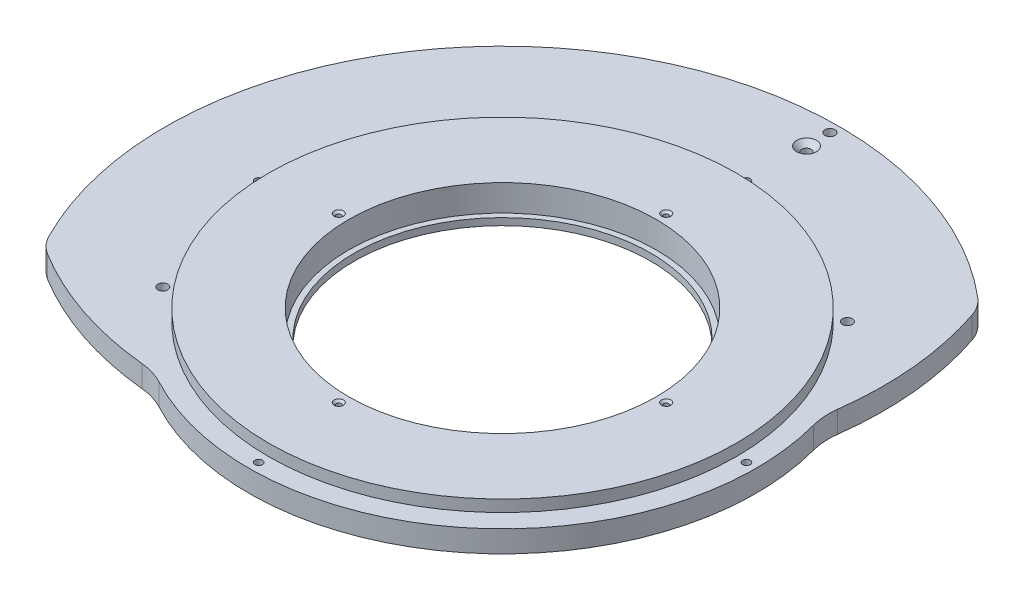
ISO-10303-21;
HEADER;
FILE_DESCRIPTION(('STEP AP214'),'2;1');
FILE_NAME('part.step','',(''),(''),'','','');
FILE_SCHEMA(('AUTOMOTIVE_DESIGN { 1 0 10303 214 1 1 1 1 }'));
ENDSEC;
DATA;
#1=APPLICATION_CONTEXT('core data for automotive mechanical design processes');
#2=APPLICATION_PROTOCOL_DEFINITION('international standard','automotive_design',2000,#1);
#3=PRODUCT_CONTEXT('',#1,'mechanical');
#4=PRODUCT('Part','Part','',(#3));
#5=PRODUCT_RELATED_PRODUCT_CATEGORY('part','',(#4));
#6=PRODUCT_DEFINITION_FORMATION('','',#4);
#7=PRODUCT_DEFINITION_CONTEXT('part definition',#1,'design');
#8=PRODUCT_DEFINITION('design','',#6,#7);
#9=PRODUCT_DEFINITION_SHAPE('','',#8);
#10=(LENGTH_UNIT() NAMED_UNIT(*) SI_UNIT(.MILLI.,.METRE.));
#11=(NAMED_UNIT(*) PLANE_ANGLE_UNIT() SI_UNIT($,.RADIAN.));
#12=(NAMED_UNIT(*) SI_UNIT($,.STERADIAN.) SOLID_ANGLE_UNIT());
#13=UNCERTAINTY_MEASURE_WITH_UNIT(LENGTH_MEASURE(1.E-05),#10,'distance_accuracy_value','');
#14=(GEOMETRIC_REPRESENTATION_CONTEXT(3) GLOBAL_UNCERTAINTY_ASSIGNED_CONTEXT((#13)) GLOBAL_UNIT_ASSIGNED_CONTEXT((#10,
#11,#12)) REPRESENTATION_CONTEXT('',''));
#15=CARTESIAN_POINT('',(0.,0.,0.));
#16=DIRECTION('',(0.,0.,1.));
#17=DIRECTION('',(1.,0.,0.));
#18=AXIS2_PLACEMENT_3D('',#15,#16,#17);
#19=CARTESIAN_POINT('',(90.8178544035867,1219.2,-108.232504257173));
#20=DIRECTION('',(0.,-1.,0.));
#21=DIRECTION('',(0.,0.,-1.));
#22=AXIS2_PLACEMENT_3D('',#19,#20,#21);
#23=CYLINDRICAL_SURFACE('',#22,18.9991999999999);
#24=CARTESIAN_POINT('',(90.8178544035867,1213.64375,-108.232504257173));
#25=DIRECTION('',(0.,1.,0.));
#26=DIRECTION('',(0.,0.,1.));
#27=AXIS2_PLACEMENT_3D('',#24,#25,#26);
#28=CIRCLE('',#27,18.9991999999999);
#29=CARTESIAN_POINT('',(108.840433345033,1213.64375,-114.245510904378));
#30=VERTEX_POINT('',#29);
#31=CARTESIAN_POINT('',(103.030304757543,1213.64375,-122.786735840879));
#32=VERTEX_POINT('',#31);
#33=EDGE_CURVE('E103',#30,#32,#28,.T.);
#34=ORIENTED_EDGE('',*,*,#33,.F.);
#35=DIRECTION('',(0.,-1.,0.));
#36=VECTOR('',#35,1.);
#37=CARTESIAN_POINT('',(108.840433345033,1219.2,-114.245510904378));
#38=LINE('',#37,#36);
#39=CARTESIAN_POINT('',(108.840433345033,1203.325,-114.245510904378));
#40=VERTEX_POINT('',#39);
#41=EDGE_CURVE('E61',#30,#40,#38,.T.);
#42=ORIENTED_EDGE('',*,*,#41,.T.);
#43=CARTESIAN_POINT('',(90.8178544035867,1203.325,-108.232504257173));
#44=DIRECTION('',(0.,1.,0.));
#45=DIRECTION('',(0.,0.,1.));
#46=AXIS2_PLACEMENT_3D('',#43,#44,#45);
#47=CIRCLE('',#46,18.9991999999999);
#48=CARTESIAN_POINT('',(103.030304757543,1203.325,-122.786735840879));
#49=VERTEX_POINT('',#48);
#50=EDGE_CURVE('E108',#40,#49,#47,.T.);
#51=ORIENTED_EDGE('',*,*,#50,.T.);
#52=DIRECTION('',(0.,-1.,0.));
#53=VECTOR('',#52,1.);
#54=CARTESIAN_POINT('',(103.030304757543,1219.2,-122.786735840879));
#55=LINE('',#54,#53);
#56=EDGE_CURVE('E46',#32,#49,#55,.T.);
#57=ORIENTED_EDGE('',*,*,#56,.F.);
#58=EDGE_LOOP('',(#34,#42,#51,#57));
#59=FACE_BOUND('',#58,.T.);
#60=ADVANCED_FACE('F38',(#59),#23,.T.);
#61=CARTESIAN_POINT('',(0.,1219.2,0.));
#62=DIRECTION('',(0.,-1.,0.));
#63=DIRECTION('',(0.,0.,-1.));
#64=AXIS2_PLACEMENT_3D('',#61,#62,#63);
#65=CYLINDRICAL_SURFACE('',#64,160.2867);
#66=CARTESIAN_POINT('',(0.,1213.64375,0.));
#67=DIRECTION('',(0.,1.,0.));
#68=DIRECTION('',(0.,0.,1.));
#69=AXIS2_PLACEMENT_3D('',#66,#67,#68);
#70=CIRCLE('',#69,160.2867);
#71=CARTESIAN_POINT('',(-142.816495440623,1213.64375,72.7686390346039));
#72=VERTEX_POINT('',#71);
#73=EDGE_CURVE('E109',#32,#72,#70,.T.);
#74=ORIENTED_EDGE('',*,*,#73,.F.);
#75=ORIENTED_EDGE('',*,*,#56,.T.);
#76=CARTESIAN_POINT('',(0.,1203.325,0.));
#77=DIRECTION('',(0.,1.,0.));
#78=DIRECTION('',(0.,0.,1.));
#79=AXIS2_PLACEMENT_3D('',#76,#77,#78);
#80=CIRCLE('',#79,160.2867);
#81=CARTESIAN_POINT('',(-142.816495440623,1203.325,72.7686390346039));
#82=VERTEX_POINT('',#81);
#83=EDGE_CURVE('E245',#49,#82,#80,.T.);
#84=ORIENTED_EDGE('',*,*,#83,.T.);
#85=DIRECTION('',(0.,-1.,0.));
#86=VECTOR('',#85,1.);
#87=CARTESIAN_POINT('',(-142.816495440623,1219.2,72.7686390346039));
#88=LINE('',#87,#86);
#89=EDGE_CURVE('E132',#72,#82,#88,.T.);
#90=ORIENTED_EDGE('',*,*,#89,.F.);
#91=EDGE_LOOP('',(#74,#75,#84,#90));
#92=FACE_BOUND('',#91,.T.);
#93=ADVANCED_FACE('F276',(#92),#65,.T.);
#94=CARTESIAN_POINT('',(-125.888084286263,1219.2,64.1431827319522));
#95=DIRECTION('',(0.,-1.,0.));
#96=DIRECTION('',(0.,0.,-1.));
#97=AXIS2_PLACEMENT_3D('',#94,#95,#96);
#98=CYLINDRICAL_SURFACE('',#97,18.9992);
#99=CARTESIAN_POINT('',(-125.888084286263,1213.64375,64.1431827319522));
#100=DIRECTION('',(0.,1.,0.));
#101=DIRECTION('',(0.,0.,1.));
#102=AXIS2_PLACEMENT_3D('',#99,#100,#101);
#103=CIRCLE('',#102,18.9992);
#104=CARTESIAN_POINT('',(-135.801176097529,1213.64375,80.351211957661));
#105=VERTEX_POINT('',#104);
#106=EDGE_CURVE('E241',#72,#105,#103,.T.);
#107=ORIENTED_EDGE('',*,*,#106,.F.);
#108=ORIENTED_EDGE('',*,*,#89,.T.);
#109=CARTESIAN_POINT('',(-125.888084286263,1203.325,64.1431827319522));
#110=DIRECTION('',(0.,1.,0.));
#111=DIRECTION('',(0.,0.,1.));
#112=AXIS2_PLACEMENT_3D('',#109,#110,#111);
#113=CIRCLE('',#112,18.9992);
#114=CARTESIAN_POINT('',(-135.801176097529,1203.325,80.351211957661));
#115=VERTEX_POINT('',#114);
#116=EDGE_CURVE('E248',#82,#115,#113,.T.);
#117=ORIENTED_EDGE('',*,*,#116,.T.);
#118=DIRECTION('',(0.,-1.,0.));
#119=VECTOR('',#118,1.);
#120=CARTESIAN_POINT('',(-135.801176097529,1219.2,80.351211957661));
#121=LINE('',#120,#119);
#122=EDGE_CURVE('E130',#105,#115,#121,.T.);
#123=ORIENTED_EDGE('',*,*,#122,.F.);
#124=EDGE_LOOP('',(#107,#108,#117,#123));
#125=FACE_BOUND('',#124,.T.);
#126=ADVANCED_FACE('F281',(#125),#98,.T.);
#127=CARTESIAN_POINT('',(-52.9977033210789,1219.2,-55.0335027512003));
#128=DIRECTION('',(0.,-1.,0.));
#129=DIRECTION('',(0.,0.,-1.));
#130=AXIS2_PLACEMENT_3D('',#127,#128,#129);
#131=CYLINDRICAL_SURFACE('',#130,158.6992);
#132=CARTESIAN_POINT('',(-52.9977033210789,1213.64375,-55.0335027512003));
#133=DIRECTION('',(0.,1.,0.));
#134=DIRECTION('',(0.,0.,1.));
#135=AXIS2_PLACEMENT_3D('',#132,#133,#134);
#136=CIRCLE('',#135,158.6992);
#137=CARTESIAN_POINT('',(-68.4508924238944,1213.64375,102.911535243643));
#138=VERTEX_POINT('',#137);
#139=EDGE_CURVE('E239',#105,#138,#136,.T.);
#140=ORIENTED_EDGE('',*,*,#139,.F.);
#141=ORIENTED_EDGE('',*,*,#122,.T.);
#142=CARTESIAN_POINT('',(-52.9977033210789,1203.325,-55.0335027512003));
#143=DIRECTION('',(0.,1.,0.));
#144=DIRECTION('',(0.,0.,1.));
#145=AXIS2_PLACEMENT_3D('',#142,#143,#144);
#146=CIRCLE('',#145,158.6992);
#147=CARTESIAN_POINT('',(-68.4508924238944,1203.325,102.911535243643));
#148=VERTEX_POINT('',#147);
#149=EDGE_CURVE('E251',#115,#148,#146,.T.);
#150=ORIENTED_EDGE('',*,*,#149,.T.);
#151=DIRECTION('',(0.,-1.,0.));
#152=VECTOR('',#151,1.);
#153=CARTESIAN_POINT('',(-68.4508924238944,1219.2,102.911535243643));
#154=LINE('',#153,#152);
#155=EDGE_CURVE('E128',#138,#148,#154,.T.);
#156=ORIENTED_EDGE('',*,*,#155,.F.);
#157=EDGE_LOOP('',(#140,#141,#150,#156));
#158=FACE_BOUND('',#157,.T.);
#159=ADVANCED_FACE('F283',(#158),#131,.T.);
#160=CARTESIAN_POINT('',(-71.5474661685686,1219.2,134.561213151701));
#161=DIRECTION('',(0.,-1.,0.));
#162=DIRECTION('',(0.,0.,-1.));
#163=AXIS2_PLACEMENT_3D('',#160,#161,#162);
#164=CYLINDRICAL_SURFACE('',#163,31.8008);
#165=CARTESIAN_POINT('',(-71.5474661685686,1213.64375,134.561213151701));
#166=DIRECTION('',(0.,1.,0.));
#167=DIRECTION('',(0.,0.,1.));
#168=AXIS2_PLACEMENT_3D('',#165,#166,#167);
#169=CIRCLE('',#168,31.8008);
#170=CARTESIAN_POINT('',(-56.6178948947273,1213.64375,106.482773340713));
#171=VERTEX_POINT('',#170);
#172=EDGE_CURVE('E237',#138,#171,#169,.F.);
#173=ORIENTED_EDGE('',*,*,#172,.F.);
#174=ORIENTED_EDGE('',*,*,#155,.T.);
#175=CARTESIAN_POINT('',(-71.5474661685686,1203.325,134.561213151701));
#176=DIRECTION('',(0.,-1.,0.));
#177=DIRECTION('',(0.,0.,1.));
#178=AXIS2_PLACEMENT_3D('',#175,#176,#177);
#179=CIRCLE('',#178,31.8008);
#180=CARTESIAN_POINT('',(-56.6178948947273,1203.325,106.482773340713));
#181=VERTEX_POINT('',#180);
#182=EDGE_CURVE('E255',#148,#181,#179,.T.);
#183=ORIENTED_EDGE('',*,*,#182,.T.);
#184=DIRECTION('',(0.,-1.,0.));
#185=VECTOR('',#184,1.);
#186=CARTESIAN_POINT('',(-56.6178948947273,1219.2,106.482773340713));
#187=LINE('',#186,#185);
#188=EDGE_CURVE('E125',#171,#181,#187,.T.);
#189=ORIENTED_EDGE('',*,*,#188,.F.);
#190=EDGE_LOOP('',(#173,#174,#183,#189));
#191=FACE_BOUND('',#190,.T.);
#192=ADVANCED_FACE('F290',(#191),#164,.F.);
#193=CARTESIAN_POINT('',(0.,1219.2,0.));
#194=DIRECTION('',(0.,-1.,0.));
#195=DIRECTION('',(0.,0.,-1.));
#196=AXIS2_PLACEMENT_3D('',#193,#194,#195);
#197=CYLINDRICAL_SURFACE('',#196,120.5992);
#198=CARTESIAN_POINT('',(0.,1213.64375,0.));
#199=DIRECTION('',(0.,1.,0.));
#200=DIRECTION('',(0.,0.,1.));
#201=AXIS2_PLACEMENT_3D('',#198,#199,#200);
#202=CIRCLE('',#201,120.5992);
#203=CARTESIAN_POINT('',(116.489881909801,1213.64375,-31.2133697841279));
#204=VERTEX_POINT('',#203);
#205=EDGE_CURVE('E235',#171,#204,#202,.T.);
#206=ORIENTED_EDGE('',*,*,#205,.F.);
#207=ORIENTED_EDGE('',*,*,#188,.T.);
#208=CARTESIAN_POINT('',(0.,1203.325,0.));
#209=DIRECTION('',(0.,1.,0.));
#210=DIRECTION('',(0.,0.,1.));
#211=AXIS2_PLACEMENT_3D('',#208,#209,#210);
#212=CIRCLE('',#211,120.5992);
#213=CARTESIAN_POINT('',(116.489881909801,1203.325,-31.2133697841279));
#214=VERTEX_POINT('',#213);
#215=EDGE_CURVE('E258',#181,#214,#212,.T.);
#216=ORIENTED_EDGE('',*,*,#215,.T.);
#217=DIRECTION('',(0.,-1.,0.));
#218=VECTOR('',#217,1.);
#219=CARTESIAN_POINT('',(116.489881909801,1219.2,-31.2133697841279));
#220=LINE('',#219,#218);
#221=EDGE_CURVE('E117',#204,#214,#220,.T.);
#222=ORIENTED_EDGE('',*,*,#221,.F.);
#223=EDGE_LOOP('',(#206,#207,#216,#222));
#224=FACE_BOUND('',#223,.T.);
#225=ADVANCED_FACE('F292',(#224),#197,.T.);
#226=CARTESIAN_POINT('',(147.207095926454,1219.2,-39.4440224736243));
#227=DIRECTION('',(0.,-1.,0.));
#228=DIRECTION('',(0.,0.,-1.));
#229=AXIS2_PLACEMENT_3D('',#226,#227,#228);
#230=CYLINDRICAL_SURFACE('',#229,31.8008000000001);
#231=CARTESIAN_POINT('',(147.207095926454,1213.64375,-39.4440224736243));
#232=DIRECTION('',(0.,1.,0.));
#233=DIRECTION('',(0.,0.,1.));
#234=AXIS2_PLACEMENT_3D('',#231,#232,#233);
#235=CIRCLE('',#234,31.8008000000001);
#236=CARTESIAN_POINT('',(115.67201968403,1213.64375,-43.5464421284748));
#237=VERTEX_POINT('',#236);
#238=EDGE_CURVE('E53',#204,#237,#235,.F.);
#239=ORIENTED_EDGE('',*,*,#238,.F.);
#240=ORIENTED_EDGE('',*,*,#221,.T.);
#241=CARTESIAN_POINT('',(147.207095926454,1203.325,-39.4440224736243));
#242=DIRECTION('',(0.,-1.,0.));
#243=DIRECTION('',(0.,0.,1.));
#244=AXIS2_PLACEMENT_3D('',#241,#242,#243);
#245=CIRCLE('',#244,31.8008000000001);
#246=CARTESIAN_POINT('',(115.67201968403,1203.325,-43.5464421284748));
#247=VERTEX_POINT('',#246);
#248=EDGE_CURVE('E120',#214,#247,#245,.T.);
#249=ORIENTED_EDGE('',*,*,#248,.T.);
#250=DIRECTION('',(0.,-1.,0.));
#251=VECTOR('',#250,1.);
#252=CARTESIAN_POINT('',(115.67201968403,1219.2,-43.5464421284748));
#253=LINE('',#252,#251);
#254=EDGE_CURVE('E115',#237,#247,#253,.T.);
#255=ORIENTED_EDGE('',*,*,#254,.F.);
#256=EDGE_LOOP('',(#239,#240,#249,#255));
#257=FACE_BOUND('',#256,.T.);
#258=ADVANCED_FACE('F266',(#257),#230,.F.);
#259=CARTESIAN_POINT('',(-41.701108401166,1219.2,-64.0192200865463));
#260=DIRECTION('',(0.,-1.,0.));
#261=DIRECTION('',(0.,0.,-1.));
#262=AXIS2_PLACEMENT_3D('',#259,#260,#261);
#263=CYLINDRICAL_SURFACE('',#262,158.6992);
#264=CARTESIAN_POINT('',(-41.701108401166,1213.64375,-64.0192200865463));
#265=DIRECTION('',(0.,1.,0.));
#266=DIRECTION('',(0.,0.,1.));
#267=AXIS2_PLACEMENT_3D('',#264,#265,#266);
#268=CIRCLE('',#267,158.6992);
#269=EDGE_CURVE('E11',#237,#30,#268,.T.);
#270=ORIENTED_EDGE('',*,*,#269,.F.);
#271=ORIENTED_EDGE('',*,*,#254,.T.);
#272=CARTESIAN_POINT('',(-41.701108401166,1203.325,-64.0192200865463));
#273=DIRECTION('',(0.,1.,0.));
#274=DIRECTION('',(0.,0.,1.));
#275=AXIS2_PLACEMENT_3D('',#272,#273,#274);
#276=CIRCLE('',#275,158.6992);
#277=EDGE_CURVE('E113',#247,#40,#276,.T.);
#278=ORIENTED_EDGE('',*,*,#277,.T.);
#279=ORIENTED_EDGE('',*,*,#41,.F.);
#280=EDGE_LOOP('',(#270,#271,#278,#279));
#281=FACE_BOUND('',#280,.T.);
#282=ADVANCED_FACE('F111',(#281),#263,.T.);
#283=CARTESIAN_POINT('',(45.4089272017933,1203.325,-54.1162521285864));
#284=DIRECTION('',(0.,1.,0.));
#285=DIRECTION('',(0.,0.,1.));
#286=AXIS2_PLACEMENT_3D('',#283,#284,#285);
#287=PLANE('',#286);
#288=CARTESIAN_POINT('',(115.8875,1203.325,1.21385713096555E-12));
#289=DIRECTION('',(0.,1.,0.));
#290=DIRECTION('',(0.,0.,1.));
#291=AXIS2_PLACEMENT_3D('',#288,#289,#290);
#292=CIRCLE('',#291,1.);
#293=CARTESIAN_POINT('',(115.8875,1203.325,1.00000000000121));
#294=VERTEX_POINT('',#293);
#295=EDGE_CURVE('E706',#294,#294,#292,.T.);
#296=ORIENTED_EDGE('',*,*,#295,.T.);
#297=EDGE_LOOP('',(#296));
#298=FACE_BOUND('',#297,.T.);
#299=CARTESIAN_POINT('',(0.,1203.325,-115.8875));
#300=DIRECTION('',(0.,1.,0.));
#301=DIRECTION('',(0.,0.,1.));
#302=AXIS2_PLACEMENT_3D('',#299,#300,#301);
#303=CIRCLE('',#302,0.999999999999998);
#304=CARTESIAN_POINT('',(0.,1203.325,-114.8875));
#305=VERTEX_POINT('',#304);
#306=EDGE_CURVE('E718',#305,#305,#303,.T.);
#307=ORIENTED_EDGE('',*,*,#306,.T.);
#308=EDGE_LOOP('',(#307));
#309=FACE_BOUND('',#308,.T.);
#310=CARTESIAN_POINT('',(-115.8875,1203.325,-4.04619043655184E-13));
#311=DIRECTION('',(0.,1.,0.));
#312=DIRECTION('',(0.,0.,1.));
#313=AXIS2_PLACEMENT_3D('',#310,#311,#312);
#314=CIRCLE('',#313,1.);
#315=CARTESIAN_POINT('',(-115.8875,1203.325,0.999999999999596));
#316=VERTEX_POINT('',#315);
#317=EDGE_CURVE('E730',#316,#316,#314,.T.);
#318=ORIENTED_EDGE('',*,*,#317,.T.);
#319=EDGE_LOOP('',(#318));
#320=FACE_BOUND('',#319,.T.);
#321=CARTESIAN_POINT('',(-8.14780813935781E-13,1203.325,-77.7875));
#322=DIRECTION('',(0.,1.,0.));
#323=DIRECTION('',(0.,0.,1.));
#324=AXIS2_PLACEMENT_3D('',#321,#322,#323);
#325=CIRCLE('',#324,1.2);
#326=CARTESIAN_POINT('',(-8.14780813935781E-13,1203.325,-76.5875));
#327=VERTEX_POINT('',#326);
#328=EDGE_CURVE('E41',#327,#327,#325,.T.);
#329=ORIENTED_EDGE('',*,*,#328,.T.);
#330=EDGE_LOOP('',(#329));
#331=FACE_BOUND('',#330,.T.);
#332=CARTESIAN_POINT('',(77.7875,1203.325,0.));
#333=DIRECTION('',(0.,1.,0.));
#334=DIRECTION('',(0.,0.,1.));
#335=AXIS2_PLACEMENT_3D('',#332,#333,#334);
#336=CIRCLE('',#335,1.19999999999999);
#337=CARTESIAN_POINT('',(77.7875,1203.325,1.19999999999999));
#338=VERTEX_POINT('',#337);
#339=EDGE_CURVE('E155',#338,#338,#336,.T.);
#340=ORIENTED_EDGE('',*,*,#339,.T.);
#341=EDGE_LOOP('',(#340));
#342=FACE_BOUND('',#341,.T.);
#343=CARTESIAN_POINT('',(2.7159360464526E-13,1203.325,77.7875));
#344=DIRECTION('',(0.,1.,0.));
#345=DIRECTION('',(0.,0.,1.));
#346=AXIS2_PLACEMENT_3D('',#343,#344,#345);
#347=CIRCLE('',#346,1.2);
#348=CARTESIAN_POINT('',(2.7159360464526E-13,1203.325,78.9875));
#349=VERTEX_POINT('',#348);
#350=EDGE_CURVE('E151',#349,#349,#347,.T.);
#351=ORIENTED_EDGE('',*,*,#350,.T.);
#352=EDGE_LOOP('',(#351));
#353=FACE_BOUND('',#352,.T.);
#354=CARTESIAN_POINT('',(0.,1203.325,-155.575));
#355=DIRECTION('',(0.,1.,0.));
#356=DIRECTION('',(0.,0.,1.));
#357=AXIS2_PLACEMENT_3D('',#354,#355,#356);
#358=CIRCLE('',#357,2.18281250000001);
#359=CARTESIAN_POINT('',(0.,1203.325,-153.3921875));
#360=VERTEX_POINT('',#359);
#361=EDGE_CURVE('E146',#360,#360,#358,.T.);
#362=ORIENTED_EDGE('',*,*,#361,.T.);
#363=EDGE_LOOP('',(#362));
#364=FACE_BOUND('',#363,.T.);
#365=CARTESIAN_POINT('',(0.,1203.325,-144.4625));
#366=DIRECTION('',(0.,1.,0.));
#367=DIRECTION('',(0.,0.,1.));
#368=AXIS2_PLACEMENT_3D('',#365,#366,#367);
#369=CIRCLE('',#368,2.25);
#370=CARTESIAN_POINT('',(0.,1203.325,-142.2125));
#371=VERTEX_POINT('',#370);
#372=EDGE_CURVE('E149',#371,#371,#369,.T.);
#373=ORIENTED_EDGE('',*,*,#372,.T.);
#374=EDGE_LOOP('',(#373));
#375=FACE_BOUND('',#374,.T.);
#376=CARTESIAN_POINT('',(-94.9294825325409,1203.325,66.4703392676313));
#377=DIRECTION('',(0.,1.,0.));
#378=DIRECTION('',(0.,0.,1.));
#379=AXIS2_PLACEMENT_3D('',#376,#377,#378);
#380=CIRCLE('',#379,2.36855000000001);
#381=CARTESIAN_POINT('',(-94.9294825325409,1203.325,68.8388892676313));
#382=VERTEX_POINT('',#381);
#383=EDGE_CURVE('E192',#382,#382,#380,.T.);
#384=ORIENTED_EDGE('',*,*,#383,.T.);
#385=EDGE_LOOP('',(#384));
#386=FACE_BOUND('',#385,.T.);
#387=CARTESIAN_POINT('',(81.944837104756,1203.325,-81.944837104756));
#388=DIRECTION('',(0.,1.,0.));
#389=DIRECTION('',(0.,0.,1.));
#390=AXIS2_PLACEMENT_3D('',#387,#388,#389);
#391=CIRCLE('',#390,2.36855000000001);
#392=CARTESIAN_POINT('',(81.944837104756,1203.325,-79.576287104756));
#393=VERTEX_POINT('',#392);
#394=EDGE_CURVE('E140',#393,#393,#391,.T.);
#395=ORIENTED_EDGE('',*,*,#394,.T.);
#396=EDGE_LOOP('',(#395));
#397=FACE_BOUND('',#396,.T.);
#398=CARTESIAN_POINT('',(0.,1203.325,115.8875));
#399=DIRECTION('',(0.,1.,0.));
#400=DIRECTION('',(0.,0.,1.));
#401=AXIS2_PLACEMENT_3D('',#398,#399,#400);
#402=CIRCLE('',#401,0.999999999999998);
#403=CARTESIAN_POINT('',(0.,1203.325,116.8875));
#404=VERTEX_POINT('',#403);
#405=EDGE_CURVE('E206',#404,#404,#402,.T.);
#406=ORIENTED_EDGE('',*,*,#405,.T.);
#407=EDGE_LOOP('',(#406));
#408=FACE_BOUND('',#407,.T.);
#409=CARTESIAN_POINT('',(-77.7875,1203.325,0.));
#410=DIRECTION('',(0.,1.,0.));
#411=DIRECTION('',(0.,0.,1.));
#412=AXIS2_PLACEMENT_3D('',#409,#410,#411);
#413=CIRCLE('',#412,1.19999999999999);
#414=CARTESIAN_POINT('',(-77.7875,1203.325,1.19999999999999));
#415=VERTEX_POINT('',#414);
#416=EDGE_CURVE('E135',#415,#415,#413,.T.);
#417=ORIENTED_EDGE('',*,*,#416,.T.);
#418=EDGE_LOOP('',(#417));
#419=FACE_BOUND('',#418,.T.);
#420=CARTESIAN_POINT('',(0.,1203.325,0.));
#421=DIRECTION('',(0.,1.,0.));
#422=DIRECTION('',(0.,0.,1.));
#423=AXIS2_PLACEMENT_3D('',#420,#421,#422);
#424=CIRCLE('',#423,70.4215);
#425=CARTESIAN_POINT('',(0.,1203.325,70.4215));
#426=VERTEX_POINT('',#425);
#427=EDGE_CURVE('E214',#426,#426,#424,.T.);
#428=ORIENTED_EDGE('',*,*,#427,.T.);
#429=EDGE_LOOP('',(#428));
#430=FACE_BOUND('',#429,.T.);
#431=ORIENTED_EDGE('',*,*,#50,.F.);
#432=ORIENTED_EDGE('',*,*,#277,.F.);
#433=ORIENTED_EDGE('',*,*,#248,.F.);
#434=ORIENTED_EDGE('',*,*,#215,.F.);
#435=ORIENTED_EDGE('',*,*,#182,.F.);
#436=ORIENTED_EDGE('',*,*,#149,.F.);
#437=ORIENTED_EDGE('',*,*,#116,.F.);
#438=ORIENTED_EDGE('',*,*,#83,.F.);
#439=EDGE_LOOP('',(#431,#432,#433,#434,#435,#436,#437,#438));
#440=FACE_BOUND('',#439,.T.);
#441=ADVANCED_FACE('F270',(#298,#309,#320,#331,#342,#353,#364,#375,#386,#397,#408,#419,#430,
#440),#287,.F.);
#442=CARTESIAN_POINT('',(0.,1213.64375,0.));
#443=DIRECTION('',(0.,1.,0.));
#444=DIRECTION('',(0.,0.,1.));
#445=AXIS2_PLACEMENT_3D('',#442,#443,#444);
#446=PLANE('',#445);
#447=CARTESIAN_POINT('',(115.8875,1213.64374999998,1.21385713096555E-12));
#448=DIRECTION('',(0.,1.,0.));
#449=DIRECTION('',(0.,0.,1.));
#450=AXIS2_PLACEMENT_3D('',#447,#448,#449);
#451=CIRCLE('',#450,1.8);
#452=CARTESIAN_POINT('',(115.8875,1213.64374999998,1.80000000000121));
#453=VERTEX_POINT('',#452);
#454=EDGE_CURVE('E699',#453,#453,#451,.T.);
#455=ORIENTED_EDGE('',*,*,#454,.F.);
#456=EDGE_LOOP('',(#455));
#457=FACE_BOUND('',#456,.T.);
#458=CARTESIAN_POINT('',(0.,1213.64374999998,-115.8875));
#459=DIRECTION('',(0.,1.,0.));
#460=DIRECTION('',(0.,0.,1.));
#461=AXIS2_PLACEMENT_3D('',#458,#459,#460);
#462=CIRCLE('',#461,1.8);
#463=CARTESIAN_POINT('',(0.,1213.64374999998,-114.0875));
#464=VERTEX_POINT('',#463);
#465=EDGE_CURVE('E709',#464,#464,#462,.T.);
#466=ORIENTED_EDGE('',*,*,#465,.F.);
#467=EDGE_LOOP('',(#466));
#468=FACE_BOUND('',#467,.T.);
#469=CARTESIAN_POINT('',(-115.8875,1213.64374999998,-4.04619043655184E-13));
#470=DIRECTION('',(0.,1.,0.));
#471=DIRECTION('',(0.,0.,1.));
#472=AXIS2_PLACEMENT_3D('',#469,#470,#471);
#473=CIRCLE('',#472,1.8);
#474=CARTESIAN_POINT('',(-115.8875,1213.64374999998,1.79999999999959));
#475=VERTEX_POINT('',#474);
#476=EDGE_CURVE('E721',#475,#475,#473,.T.);
#477=ORIENTED_EDGE('',*,*,#476,.F.);
#478=EDGE_LOOP('',(#477));
#479=FACE_BOUND('',#478,.T.);
#480=CARTESIAN_POINT('',(0.,1213.64375000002,-155.575));
#481=DIRECTION('',(0.,1.,0.));
#482=DIRECTION('',(0.,0.,1.));
#483=AXIS2_PLACEMENT_3D('',#480,#481,#482);
#484=CIRCLE('',#483,2.39395);
#485=CARTESIAN_POINT('',(0.,1213.64375000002,-153.18105));
#486=VERTEX_POINT('',#485);
#487=EDGE_CURVE('E153',#486,#486,#484,.T.);
#488=ORIENTED_EDGE('',*,*,#487,.F.);
#489=EDGE_LOOP('',(#488));
#490=FACE_BOUND('',#489,.T.);
#491=CARTESIAN_POINT('',(0.,1213.64375000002,-144.4625));
#492=DIRECTION('',(0.,1.,0.));
#493=DIRECTION('',(0.,0.,1.));
#494=AXIS2_PLACEMENT_3D('',#491,#492,#493);
#495=CIRCLE('',#494,4.7);
#496=CARTESIAN_POINT('',(0.,1213.64375000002,-139.7625));
#497=VERTEX_POINT('',#496);
#498=EDGE_CURVE('E186',#497,#497,#495,.T.);
#499=ORIENTED_EDGE('',*,*,#498,.F.);
#500=EDGE_LOOP('',(#499));
#501=FACE_BOUND('',#500,.T.);
#502=CARTESIAN_POINT('',(-94.9294825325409,1213.64374999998,66.4703392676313));
#503=DIRECTION('',(0.,1.,0.));
#504=DIRECTION('',(0.,0.,1.));
#505=AXIS2_PLACEMENT_3D('',#502,#503,#504);
#506=CIRCLE('',#505,2.36855000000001);
#507=CARTESIAN_POINT('',(-94.9294825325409,1213.64374999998,68.8388892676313));
#508=VERTEX_POINT('',#507);
#509=EDGE_CURVE('E189',#508,#508,#506,.T.);
#510=ORIENTED_EDGE('',*,*,#509,.F.);
#511=EDGE_LOOP('',(#510));
#512=FACE_BOUND('',#511,.T.);
#513=CARTESIAN_POINT('',(81.944837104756,1213.64374999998,-81.944837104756));
#514=DIRECTION('',(0.,1.,0.));
#515=DIRECTION('',(0.,0.,1.));
#516=AXIS2_PLACEMENT_3D('',#513,#514,#515);
#517=CIRCLE('',#516,2.36855000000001);
#518=CARTESIAN_POINT('',(81.944837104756,1213.64374999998,-79.576287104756));
#519=VERTEX_POINT('',#518);
#520=EDGE_CURVE('E145',#519,#519,#517,.T.);
#521=ORIENTED_EDGE('',*,*,#520,.F.);
#522=EDGE_LOOP('',(#521));
#523=FACE_BOUND('',#522,.T.);
#524=CARTESIAN_POINT('',(0.,1213.64374999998,115.8875));
#525=DIRECTION('',(0.,1.,0.));
#526=DIRECTION('',(0.,0.,1.));
#527=AXIS2_PLACEMENT_3D('',#524,#525,#526);
#528=CIRCLE('',#527,1.8);
#529=CARTESIAN_POINT('',(0.,1213.64374999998,117.6875));
#530=VERTEX_POINT('',#529);
#531=EDGE_CURVE('E144',#530,#530,#528,.T.);
#532=ORIENTED_EDGE('',*,*,#531,.F.);
#533=EDGE_LOOP('',(#532));
#534=FACE_BOUND('',#533,.T.);
#535=CARTESIAN_POINT('',(0.,1213.64375,0.));
#536=DIRECTION('',(0.,1.,0.));
#537=DIRECTION('',(0.,0.,1.));
#538=AXIS2_PLACEMENT_3D('',#535,#536,#537);
#539=CIRCLE('',#538,111.125);
#540=CARTESIAN_POINT('',(0.,1213.64375,111.125));
#541=VERTEX_POINT('',#540);
#542=EDGE_CURVE('E229',#541,#541,#539,.T.);
#543=ORIENTED_EDGE('',*,*,#542,.F.);
#544=EDGE_LOOP('',(#543));
#545=FACE_BOUND('',#544,.T.);
#546=ORIENTED_EDGE('',*,*,#33,.T.);
#547=ORIENTED_EDGE('',*,*,#73,.T.);
#548=ORIENTED_EDGE('',*,*,#106,.T.);
#549=ORIENTED_EDGE('',*,*,#139,.T.);
#550=ORIENTED_EDGE('',*,*,#172,.T.);
#551=ORIENTED_EDGE('',*,*,#205,.T.);
#552=ORIENTED_EDGE('',*,*,#238,.T.);
#553=ORIENTED_EDGE('',*,*,#269,.T.);
#554=EDGE_LOOP('',(#546,#547,#548,#549,#550,#551,#552,#553));
#555=FACE_BOUND('',#554,.T.);
#556=ADVANCED_FACE('F102',(#457,#468,#479,#490,#501,#512,#523,#534,#545,#555),#446,.T.);
#557=CARTESIAN_POINT('',(0.,1213.64375,0.));
#558=DIRECTION('',(0.,1.,0.));
#559=DIRECTION('',(0.,0.,1.));
#560=AXIS2_PLACEMENT_3D('',#557,#558,#559);
#561=CYLINDRICAL_SURFACE('',#560,111.125);
#562=ORIENTED_EDGE('',*,*,#542,.T.);
#563=EDGE_LOOP('',(#562));
#564=FACE_BOUND('',#563,.T.);
#565=CARTESIAN_POINT('',(0.,1219.2,0.));
#566=DIRECTION('',(0.,1.,0.));
#567=DIRECTION('',(0.,0.,1.));
#568=AXIS2_PLACEMENT_3D('',#565,#566,#567);
#569=CIRCLE('',#568,111.125);
#570=CARTESIAN_POINT('',(0.,1219.2,111.125));
#571=VERTEX_POINT('',#570);
#572=EDGE_CURVE('E225',#571,#571,#569,.T.);
#573=ORIENTED_EDGE('',*,*,#572,.F.);
#574=EDGE_LOOP('',(#573));
#575=FACE_BOUND('',#574,.T.);
#576=ADVANCED_FACE('F344',(#564,#575),#561,.T.);
#577=CARTESIAN_POINT('',(45.4089272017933,1219.2,-54.1162521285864));
#578=DIRECTION('',(0.,1.,0.));
#579=DIRECTION('',(0.,0.,1.));
#580=AXIS2_PLACEMENT_3D('',#577,#578,#579);
#581=PLANE('',#580);
#582=CARTESIAN_POINT('',(-8.14780813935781E-13,1219.20000000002,-77.7875));
#583=DIRECTION('',(0.,1.,0.));
#584=DIRECTION('',(0.,0.,1.));
#585=AXIS2_PLACEMENT_3D('',#582,#583,#584);
#586=CIRCLE('',#585,2.2);
#587=CARTESIAN_POINT('',(-8.14780813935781E-13,1219.20000000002,-75.5875));
#588=VERTEX_POINT('',#587);
#589=EDGE_CURVE('E733',#588,#588,#586,.T.);
#590=ORIENTED_EDGE('',*,*,#589,.F.);
#591=EDGE_LOOP('',(#590));
#592=FACE_BOUND('',#591,.T.);
#593=CARTESIAN_POINT('',(77.7875,1219.20000000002,0.));
#594=DIRECTION('',(0.,1.,0.));
#595=DIRECTION('',(0.,0.,1.));
#596=AXIS2_PLACEMENT_3D('',#593,#594,#595);
#597=CIRCLE('',#596,2.19999999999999);
#598=CARTESIAN_POINT('',(77.7875,1219.20000000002,2.19999999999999));
#599=VERTEX_POINT('',#598);
#600=EDGE_CURVE('E164',#599,#599,#597,.T.);
#601=ORIENTED_EDGE('',*,*,#600,.F.);
#602=EDGE_LOOP('',(#601));
#603=FACE_BOUND('',#602,.T.);
#604=CARTESIAN_POINT('',(2.7159360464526E-13,1219.20000000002,77.7875));
#605=DIRECTION('',(0.,1.,0.));
#606=DIRECTION('',(0.,0.,1.));
#607=AXIS2_PLACEMENT_3D('',#604,#605,#606);
#608=CIRCLE('',#607,2.2);
#609=CARTESIAN_POINT('',(2.7159360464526E-13,1219.20000000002,79.9875));
#610=VERTEX_POINT('',#609);
#611=EDGE_CURVE('E157',#610,#610,#608,.T.);
#612=ORIENTED_EDGE('',*,*,#611,.F.);
#613=EDGE_LOOP('',(#612));
#614=FACE_BOUND('',#613,.T.);
#615=CARTESIAN_POINT('',(-77.7875,1219.20000000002,0.));
#616=DIRECTION('',(0.,1.,0.));
#617=DIRECTION('',(0.,0.,1.));
#618=AXIS2_PLACEMENT_3D('',#615,#616,#617);
#619=CIRCLE('',#618,2.19999999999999);
#620=CARTESIAN_POINT('',(-77.7875,1219.20000000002,2.19999999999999));
#621=VERTEX_POINT('',#620);
#622=EDGE_CURVE('E139',#621,#621,#619,.T.);
#623=ORIENTED_EDGE('',*,*,#622,.F.);
#624=EDGE_LOOP('',(#623));
#625=FACE_BOUND('',#624,.T.);
#626=CARTESIAN_POINT('',(0.,1219.2,0.));
#627=DIRECTION('',(0.,1.,0.));
#628=DIRECTION('',(0.,0.,1.));
#629=AXIS2_PLACEMENT_3D('',#626,#627,#628);
#630=CIRCLE('',#629,73.03135);
#631=CARTESIAN_POINT('',(0.,1219.2,73.03135));
#632=VERTEX_POINT('',#631);
#633=EDGE_CURVE('E218',#632,#632,#630,.T.);
#634=ORIENTED_EDGE('',*,*,#633,.F.);
#635=EDGE_LOOP('',(#634));
#636=FACE_BOUND('',#635,.T.);
#637=ORIENTED_EDGE('',*,*,#572,.T.);
#638=EDGE_LOOP('',(#637));
#639=FACE_BOUND('',#638,.T.);
#640=ADVANCED_FACE('F349',(#592,#603,#614,#625,#636,#639),#581,.T.);
#641=CARTESIAN_POINT('',(0.,1206.6524,0.));
#642=DIRECTION('',(0.,1.,0.));
#643=DIRECTION('',(0.,0.,1.));
#644=AXIS2_PLACEMENT_3D('',#641,#642,#643);
#645=CYLINDRICAL_SURFACE('',#644,73.03135);
#646=CARTESIAN_POINT('',(0.,1206.6524,0.));
#647=DIRECTION('',(0.,1.,0.));
#648=DIRECTION('',(0.,0.,1.));
#649=AXIS2_PLACEMENT_3D('',#646,#647,#648);
#650=CIRCLE('',#649,73.03135);
#651=CARTESIAN_POINT('',(0.,1206.6524,73.03135));
#652=VERTEX_POINT('',#651);
#653=EDGE_CURVE('E221',#652,#652,#650,.T.);
#654=CARTESIAN_POINT('',(0.,1206.6524,73.03135));
#655=CARTESIAN_POINT('',(0.,1206.78310416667,73.03135));
#656=CARTESIAN_POINT('',(0.,1206.91380833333,73.03135));
#657=CARTESIAN_POINT('',(0.,1207.17521666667,73.03135));
#658=CARTESIAN_POINT('',(0.,1207.30592083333,73.03135));
#659=CARTESIAN_POINT('',(0.,1207.56732916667,73.03135));
#660=CARTESIAN_POINT('',(0.,1207.69803333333,73.03135));
#661=CARTESIAN_POINT('',(0.,1207.95944166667,73.03135));
#662=CARTESIAN_POINT('',(0.,1208.09014583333,73.03135));
#663=CARTESIAN_POINT('',(0.,1208.35155416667,73.03135));
#664=CARTESIAN_POINT('',(0.,1208.48225833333,73.03135));
#665=CARTESIAN_POINT('',(0.,1208.74366666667,73.03135));
#666=CARTESIAN_POINT('',(0.,1208.87437083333,73.03135));
#667=CARTESIAN_POINT('',(0.,1209.13577916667,73.03135));
#668=CARTESIAN_POINT('',(0.,1209.26648333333,73.03135));
#669=CARTESIAN_POINT('',(0.,1209.52789166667,73.03135));
#670=CARTESIAN_POINT('',(0.,1209.65859583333,73.03135));
#671=CARTESIAN_POINT('',(0.,1209.92000416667,73.03135));
#672=CARTESIAN_POINT('',(0.,1210.05070833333,73.03135));
#673=CARTESIAN_POINT('',(0.,1210.31211666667,73.03135));
#674=CARTESIAN_POINT('',(0.,1210.44282083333,73.03135));
#675=CARTESIAN_POINT('',(0.,1210.70422916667,73.03135));
#676=CARTESIAN_POINT('',(0.,1210.83493333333,73.03135));
#677=CARTESIAN_POINT('',(0.,1211.09634166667,73.03135));
#678=CARTESIAN_POINT('',(0.,1211.22704583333,73.03135));
#679=CARTESIAN_POINT('',(0.,1211.48845416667,73.03135));
#680=CARTESIAN_POINT('',(0.,1211.61915833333,73.03135));
#681=CARTESIAN_POINT('',(0.,1211.88056666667,73.03135));
#682=CARTESIAN_POINT('',(0.,1212.01127083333,73.03135));
#683=CARTESIAN_POINT('',(0.,1212.27267916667,73.03135));
#684=CARTESIAN_POINT('',(0.,1212.40338333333,73.03135));
#685=CARTESIAN_POINT('',(0.,1212.66479166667,73.03135));
#686=CARTESIAN_POINT('',(0.,1212.79549583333,73.03135));
#687=CARTESIAN_POINT('',(0.,1213.05690416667,73.03135));
#688=CARTESIAN_POINT('',(0.,1213.18760833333,73.03135));
#689=CARTESIAN_POINT('',(0.,1213.44901666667,73.03135));
#690=CARTESIAN_POINT('',(0.,1213.57972083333,73.03135));
#691=CARTESIAN_POINT('',(0.,1213.84112916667,73.03135));
#692=CARTESIAN_POINT('',(0.,1213.97183333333,73.03135));
#693=CARTESIAN_POINT('',(0.,1214.23324166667,73.03135));
#694=CARTESIAN_POINT('',(0.,1214.36394583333,73.03135));
#695=CARTESIAN_POINT('',(0.,1214.62535416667,73.03135));
#696=CARTESIAN_POINT('',(0.,1214.75605833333,73.03135));
#697=CARTESIAN_POINT('',(0.,1215.01746666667,73.03135));
#698=CARTESIAN_POINT('',(0.,1215.14817083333,73.03135));
#699=CARTESIAN_POINT('',(0.,1215.40957916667,73.03135));
#700=CARTESIAN_POINT('',(0.,1215.54028333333,73.03135));
#701=CARTESIAN_POINT('',(0.,1215.80169166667,73.03135));
#702=CARTESIAN_POINT('',(0.,1215.93239583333,73.03135));
#703=CARTESIAN_POINT('',(0.,1216.19380416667,73.03135));
#704=CARTESIAN_POINT('',(0.,1216.32450833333,73.03135));
#705=CARTESIAN_POINT('',(0.,1216.58591666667,73.03135));
#706=CARTESIAN_POINT('',(0.,1216.71662083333,73.03135));
#707=CARTESIAN_POINT('',(0.,1216.97802916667,73.03135));
#708=CARTESIAN_POINT('',(0.,1217.10873333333,73.03135));
#709=CARTESIAN_POINT('',(0.,1217.37014166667,73.03135));
#710=CARTESIAN_POINT('',(0.,1217.50084583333,73.03135));
#711=CARTESIAN_POINT('',(0.,1217.76225416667,73.03135));
#712=CARTESIAN_POINT('',(0.,1217.89295833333,73.03135));
#713=CARTESIAN_POINT('',(0.,1218.15436666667,73.03135));
#714=CARTESIAN_POINT('',(0.,1218.28507083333,73.03135));
#715=CARTESIAN_POINT('',(0.,1218.54647916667,73.03135));
#716=CARTESIAN_POINT('',(0.,1218.67718333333,73.03135));
#717=CARTESIAN_POINT('',(0.,1218.93859166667,73.03135));
#718=CARTESIAN_POINT('',(0.,1219.06929583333,73.03135));
#719=CARTESIAN_POINT('',(0.,1219.2,73.03135));
#720=B_SPLINE_CURVE_WITH_KNOTS('',3,(#654,#655,#656,#657,#658,#659,#660,#661,#662,#663,#664,
#665,#666,#667,#668,#669,#670,#671,#672,#673,#674,#675,#676,#677,#678,#679,#680,#681,#682,#683,
#684,#685,#686,#687,#688,#689,#690,#691,#692,#693,#694,#695,#696,#697,#698,#699,#700,#701,#702,
#703,#704,#705,#706,#707,#708,#709,#710,#711,#712,#713,#714,#715,#716,#717,#718,#719),
.UNSPECIFIED.,.F.,.F.,(4,2,2,2,2,2,2,2,2,2,2,2,2,2,2,2,2,2,2,2,2,2,2,2,2,2,2,2,2,2,2,2,4),(0.,
0.392112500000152,0.784225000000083,1.17633750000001,1.56845000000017,1.9605625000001,
2.35267500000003,2.74478750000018,3.13690000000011,3.52901250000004,3.92112500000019,
4.31323750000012,4.70535000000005,5.0974625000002,5.48957500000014,5.88168750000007,
6.27380000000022,6.66591250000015,7.05802500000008,7.45013750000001,7.84225000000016,
8.23436250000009,8.62647500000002,9.01858750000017,9.41070000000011,9.80281250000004,
10.1949250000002,10.5870375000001,10.97915,11.3712625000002,11.7633750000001,12.1554875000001,
12.5476000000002),.UNSPECIFIED.);
#721=EDGE_CURVE('BSEAM359',#652,#632,#720,.T.);
#722=ORIENTED_EDGE('',*,*,#653,.F.);
#723=ORIENTED_EDGE('',*,*,#633,.T.);
#724=ORIENTED_EDGE('',*,*,#721,.T.);
#725=ORIENTED_EDGE('',*,*,#721,.F.);
#726=EDGE_LOOP('',(#722,#724,#723,#725));
#727=FACE_BOUND('',#726,.T.);
#728=ADVANCED_FACE('F359',(#727),#645,.F.);
#729=CARTESIAN_POINT('',(0.,1206.6524,0.));
#730=DIRECTION('',(0.,1.,0.));
#731=DIRECTION('',(0.,0.,1.));
#732=AXIS2_PLACEMENT_3D('',#729,#730,#731);
#733=PLANE('',#732);
#734=CARTESIAN_POINT('',(0.,1206.6524,0.));
#735=DIRECTION('',(0.,1.,0.));
#736=DIRECTION('',(0.,0.,1.));
#737=AXIS2_PLACEMENT_3D('',#734,#735,#736);
#738=CIRCLE('',#737,70.4215);
#739=CARTESIAN_POINT('',(0.,1206.6524,70.4215));
#740=VERTEX_POINT('',#739);
#741=EDGE_CURVE('E138',#740,#740,#738,.T.);
#742=ORIENTED_EDGE('',*,*,#741,.F.);
#743=EDGE_LOOP('',(#742));
#744=FACE_BOUND('',#743,.T.);
#745=ORIENTED_EDGE('',*,*,#653,.T.);
#746=EDGE_LOOP('',(#745));
#747=FACE_BOUND('',#746,.T.);
#748=ADVANCED_FACE('F364',(#744,#747),#733,.T.);
#749=CARTESIAN_POINT('',(0.,1203.325,0.));
#750=DIRECTION('',(0.,1.,0.));
#751=DIRECTION('',(0.,0.,1.));
#752=AXIS2_PLACEMENT_3D('',#749,#750,#751);
#753=CYLINDRICAL_SURFACE('',#752,70.4215);
#754=CARTESIAN_POINT('',(0.,1203.325,70.4215));
#755=CARTESIAN_POINT('',(0.,1203.35966041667,70.4215));
#756=CARTESIAN_POINT('',(0.,1203.39432083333,70.4215));
#757=CARTESIAN_POINT('',(0.,1203.46364166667,70.4215));
#758=CARTESIAN_POINT('',(0.,1203.49830208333,70.4215));
#759=CARTESIAN_POINT('',(0.,1203.56762291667,70.4215));
#760=CARTESIAN_POINT('',(0.,1203.60228333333,70.4215));
#761=CARTESIAN_POINT('',(0.,1203.67160416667,70.4215));
#762=CARTESIAN_POINT('',(0.,1203.70626458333,70.4215));
#763=CARTESIAN_POINT('',(0.,1203.77558541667,70.4215));
#764=CARTESIAN_POINT('',(0.,1203.81024583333,70.4215));
#765=CARTESIAN_POINT('',(0.,1203.87956666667,70.4215));
#766=CARTESIAN_POINT('',(0.,1203.91422708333,70.4215));
#767=CARTESIAN_POINT('',(0.,1203.98354791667,70.4215));
#768=CARTESIAN_POINT('',(0.,1204.01820833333,70.4215));
#769=CARTESIAN_POINT('',(0.,1204.08752916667,70.4215));
#770=CARTESIAN_POINT('',(0.,1204.12218958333,70.4215));
#771=CARTESIAN_POINT('',(0.,1204.19151041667,70.4215));
#772=CARTESIAN_POINT('',(0.,1204.22617083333,70.4215));
#773=CARTESIAN_POINT('',(0.,1204.29549166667,70.4215));
#774=CARTESIAN_POINT('',(0.,1204.33015208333,70.4215));
#775=CARTESIAN_POINT('',(0.,1204.39947291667,70.4215));
#776=CARTESIAN_POINT('',(0.,1204.43413333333,70.4215));
#777=CARTESIAN_POINT('',(0.,1204.50345416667,70.4215));
#778=CARTESIAN_POINT('',(0.,1204.53811458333,70.4215));
#779=CARTESIAN_POINT('',(0.,1204.60743541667,70.4215));
#780=CARTESIAN_POINT('',(0.,1204.64209583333,70.4215));
#781=CARTESIAN_POINT('',(0.,1204.71141666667,70.4215));
#782=CARTESIAN_POINT('',(0.,1204.74607708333,70.4215));
#783=CARTESIAN_POINT('',(0.,1204.81539791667,70.4215));
#784=CARTESIAN_POINT('',(0.,1204.85005833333,70.4215));
#785=CARTESIAN_POINT('',(0.,1204.91937916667,70.4215));
#786=CARTESIAN_POINT('',(0.,1204.95403958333,70.4215));
#787=CARTESIAN_POINT('',(0.,1205.02336041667,70.4215));
#788=CARTESIAN_POINT('',(0.,1205.05802083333,70.4215));
#789=CARTESIAN_POINT('',(0.,1205.12734166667,70.4215));
#790=CARTESIAN_POINT('',(0.,1205.16200208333,70.4215));
#791=CARTESIAN_POINT('',(0.,1205.23132291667,70.4215));
#792=CARTESIAN_POINT('',(0.,1205.26598333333,70.4215));
#793=CARTESIAN_POINT('',(0.,1205.33530416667,70.4215));
#794=CARTESIAN_POINT('',(0.,1205.36996458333,70.4215));
#795=CARTESIAN_POINT('',(0.,1205.43928541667,70.4215));
#796=CARTESIAN_POINT('',(0.,1205.47394583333,70.4215));
#797=CARTESIAN_POINT('',(0.,1205.54326666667,70.4215));
#798=CARTESIAN_POINT('',(0.,1205.57792708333,70.4215));
#799=CARTESIAN_POINT('',(0.,1205.64724791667,70.4215));
#800=CARTESIAN_POINT('',(0.,1205.68190833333,70.4215));
#801=CARTESIAN_POINT('',(0.,1205.75122916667,70.4215));
#802=CARTESIAN_POINT('',(0.,1205.78588958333,70.4215));
#803=CARTESIAN_POINT('',(0.,1205.85521041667,70.4215));
#804=CARTESIAN_POINT('',(0.,1205.88987083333,70.4215));
#805=CARTESIAN_POINT('',(0.,1205.95919166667,70.4215));
#806=CARTESIAN_POINT('',(0.,1205.99385208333,70.4215));
#807=CARTESIAN_POINT('',(0.,1206.06317291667,70.4215));
#808=CARTESIAN_POINT('',(0.,1206.09783333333,70.4215));
#809=CARTESIAN_POINT('',(0.,1206.16715416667,70.4215));
#810=CARTESIAN_POINT('',(0.,1206.20181458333,70.4215));
#811=CARTESIAN_POINT('',(0.,1206.27113541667,70.4215));
#812=CARTESIAN_POINT('',(0.,1206.30579583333,70.4215));
#813=CARTESIAN_POINT('',(0.,1206.37511666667,70.4215));
#814=CARTESIAN_POINT('',(0.,1206.40977708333,70.4215));
#815=CARTESIAN_POINT('',(0.,1206.47909791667,70.4215));
#816=CARTESIAN_POINT('',(0.,1206.51375833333,70.4215));
#817=CARTESIAN_POINT('',(0.,1206.58307916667,70.4215));
#818=CARTESIAN_POINT('',(0.,1206.61773958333,70.4215));
#819=CARTESIAN_POINT('',(0.,1206.6524,70.4215));
#820=B_SPLINE_CURVE_WITH_KNOTS('',3,(#754,#755,#756,#757,#758,#759,#760,#761,#762,#763,#764,
#765,#766,#767,#768,#769,#770,#771,#772,#773,#774,#775,#776,#777,#778,#779,#780,#781,#782,#783,
#784,#785,#786,#787,#788,#789,#790,#791,#792,#793,#794,#795,#796,#797,#798,#799,#800,#801,#802,
#803,#804,#805,#806,#807,#808,#809,#810,#811,#812,#813,#814,#815,#816,#817,#818,#819),
.UNSPECIFIED.,.F.,.F.,(4,2,2,2,2,2,2,2,2,2,2,2,2,2,2,2,2,2,2,2,2,2,2,2,2,2,2,2,2,2,2,2,4),(0.,
0.103981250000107,0.207962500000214,0.311943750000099,0.415925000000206,0.519906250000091,
0.623887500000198,0.727868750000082,0.831850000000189,0.935831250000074,1.03981250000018,
1.14379375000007,1.24777500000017,1.35175625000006,1.45573750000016,1.55971875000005,
1.66370000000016,1.76768125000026,1.87166250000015,1.97564375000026,2.07962500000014,
2.18360625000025,2.28758750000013,2.39156875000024,2.49555000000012,2.59953125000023,
2.70351250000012,2.80749375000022,2.91147500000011,3.01545625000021,3.1194375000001,
3.22341875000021,3.32740000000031),.UNSPECIFIED.);
#821=EDGE_CURVE('BSEAM374',#426,#740,#820,.T.);
#822=ORIENTED_EDGE('',*,*,#427,.F.);
#823=ORIENTED_EDGE('',*,*,#741,.T.);
#824=ORIENTED_EDGE('',*,*,#821,.T.);
#825=ORIENTED_EDGE('',*,*,#821,.F.);
#826=EDGE_LOOP('',(#822,#824,#823,#825));
#827=FACE_BOUND('',#826,.T.);
#828=ADVANCED_FACE('F374',(#827),#753,.F.);
#829=CARTESIAN_POINT('',(-77.7875,1219.20000000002,0.));
#830=DIRECTION('',(0.,1.,0.));
#831=DIRECTION('',(0.,0.,1.));
#832=AXIS2_PLACEMENT_3D('',#829,#830,#831);
#833=CYLINDRICAL_SURFACE('',#832,1.19999999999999);
#834=CARTESIAN_POINT('',(-77.7875,1218.20000000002,0.));
#835=DIRECTION('',(0.,1.,0.));
#836=DIRECTION('',(0.,0.,1.));
#837=AXIS2_PLACEMENT_3D('',#834,#835,#836);
#838=CIRCLE('',#837,1.19999999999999);
#839=CARTESIAN_POINT('',(-77.7875,1218.20000000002,1.19999999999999));
#840=VERTEX_POINT('',#839);
#841=EDGE_CURVE('E209',#840,#840,#838,.T.);
#842=ORIENTED_EDGE('',*,*,#841,.T.);
#843=EDGE_LOOP('',(#842));
#844=FACE_BOUND('',#843,.T.);
#845=ORIENTED_EDGE('',*,*,#416,.F.);
#846=EDGE_LOOP('',(#845));
#847=FACE_BOUND('',#846,.T.);
#848=ADVANCED_FACE('F385',(#844,#847),#833,.F.);
#849=CARTESIAN_POINT('',(-77.7875,1219.20000000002,0.));
#850=DIRECTION('',(0.,1.,0.));
#851=DIRECTION('',(0.,0.,1.));
#852=AXIS2_PLACEMENT_3D('',#849,#850,#851);
#853=CONICAL_SURFACE('',#852,2.19999999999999,0.785398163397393);
#854=ORIENTED_EDGE('',*,*,#841,.F.);
#855=EDGE_LOOP('',(#854));
#856=FACE_BOUND('',#855,.T.);
#857=ORIENTED_EDGE('',*,*,#622,.T.);
#858=EDGE_LOOP('',(#857));
#859=FACE_BOUND('',#858,.T.);
#860=ADVANCED_FACE('F397',(#856,#859),#853,.F.);
#861=CARTESIAN_POINT('',(0.,1213.64374999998,115.8875));
#862=DIRECTION('',(0.,1.,0.));
#863=DIRECTION('',(0.,0.,1.));
#864=AXIS2_PLACEMENT_3D('',#861,#862,#863);
#865=CYLINDRICAL_SURFACE('',#864,1.);
#866=ORIENTED_EDGE('',*,*,#405,.F.);
#867=EDGE_LOOP('',(#866));
#868=FACE_BOUND('',#867,.T.);
#869=CARTESIAN_POINT('',(0.,1210.30374999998,115.8875));
#870=DIRECTION('',(0.,1.,0.));
#871=DIRECTION('',(0.,0.,1.));
#872=AXIS2_PLACEMENT_3D('',#869,#870,#871);
#873=CIRCLE('',#872,1.);
#874=CARTESIAN_POINT('',(0.,1210.30374999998,116.8875));
#875=VERTEX_POINT('',#874);
#876=EDGE_CURVE('E203',#875,#875,#873,.T.);
#877=ORIENTED_EDGE('',*,*,#876,.T.);
#878=EDGE_LOOP('',(#877));
#879=FACE_BOUND('',#878,.T.);
#880=ADVANCED_FACE('F409',(#868,#879),#865,.F.);
#881=CARTESIAN_POINT('',(0.,1211.10374999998,115.8875));
#882=DIRECTION('',(0.,1.,0.));
#883=DIRECTION('',(0.,0.,1.));
#884=AXIS2_PLACEMENT_3D('',#881,#882,#883);
#885=CONICAL_SURFACE('',#884,1.8,0.785398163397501);
#886=ORIENTED_EDGE('',*,*,#876,.F.);
#887=EDGE_LOOP('',(#886));
#888=FACE_BOUND('',#887,.T.);
#889=CARTESIAN_POINT('',(0.,1211.10374999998,115.8875));
#890=DIRECTION('',(0.,1.,0.));
#891=DIRECTION('',(0.,0.,1.));
#892=AXIS2_PLACEMENT_3D('',#889,#890,#891);
#893=CIRCLE('',#892,1.8);
#894=CARTESIAN_POINT('',(0.,1211.10374999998,117.6875));
#895=VERTEX_POINT('',#894);
#896=EDGE_CURVE('E200',#895,#895,#893,.T.);
#897=ORIENTED_EDGE('',*,*,#896,.T.);
#898=EDGE_LOOP('',(#897));
#899=FACE_BOUND('',#898,.T.);
#900=ADVANCED_FACE('F419',(#888,#899),#885,.F.);
#901=CARTESIAN_POINT('',(0.,1213.64374999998,115.8875));
#902=DIRECTION('',(0.,1.,0.));
#903=DIRECTION('',(0.,0.,1.));
#904=AXIS2_PLACEMENT_3D('',#901,#902,#903);
#905=CYLINDRICAL_SURFACE('',#904,1.8);
#906=ORIENTED_EDGE('',*,*,#896,.F.);
#907=EDGE_LOOP('',(#906));
#908=FACE_BOUND('',#907,.T.);
#909=ORIENTED_EDGE('',*,*,#531,.T.);
#910=EDGE_LOOP('',(#909));
#911=FACE_BOUND('',#910,.T.);
#912=ADVANCED_FACE('F429',(#908,#911),#905,.F.);
#913=CARTESIAN_POINT('',(81.944837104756,1213.64374999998,-81.944837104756));
#914=DIRECTION('',(0.,1.,0.));
#915=DIRECTION('',(0.,0.,1.));
#916=AXIS2_PLACEMENT_3D('',#913,#914,#915);
#917=CYLINDRICAL_SURFACE('',#916,2.36855000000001);
#918=ORIENTED_EDGE('',*,*,#520,.T.);
#919=EDGE_LOOP('',(#918));
#920=FACE_BOUND('',#919,.T.);
#921=ORIENTED_EDGE('',*,*,#394,.F.);
#922=EDGE_LOOP('',(#921));
#923=FACE_BOUND('',#922,.T.);
#924=ADVANCED_FACE('F439',(#920,#923),#917,.F.);
#925=CARTESIAN_POINT('',(-94.9294825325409,1213.64374999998,66.4703392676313));
#926=DIRECTION('',(0.,1.,0.));
#927=DIRECTION('',(0.,0.,1.));
#928=AXIS2_PLACEMENT_3D('',#925,#926,#927);
#929=CYLINDRICAL_SURFACE('',#928,2.36855000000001);
#930=ORIENTED_EDGE('',*,*,#509,.T.);
#931=EDGE_LOOP('',(#930));
#932=FACE_BOUND('',#931,.T.);
#933=ORIENTED_EDGE('',*,*,#383,.F.);
#934=EDGE_LOOP('',(#933));
#935=FACE_BOUND('',#934,.T.);
#936=ADVANCED_FACE('F449',(#932,#935),#929,.F.);
#937=CARTESIAN_POINT('',(0.,1213.64375000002,-144.4625));
#938=DIRECTION('',(0.,1.,0.));
#939=DIRECTION('',(0.,0.,1.));
#940=AXIS2_PLACEMENT_3D('',#937,#938,#939);
#941=CONICAL_SURFACE('',#940,4.7,0.785398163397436);
#942=CARTESIAN_POINT('',(0.,1211.19375000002,-144.4625));
#943=DIRECTION('',(0.,1.,0.));
#944=DIRECTION('',(0.,0.,1.));
#945=AXIS2_PLACEMENT_3D('',#942,#943,#944);
#946=CIRCLE('',#945,2.25);
#947=CARTESIAN_POINT('',(0.,1211.19375000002,-142.2125));
#948=VERTEX_POINT('',#947);
#949=EDGE_CURVE('E183',#948,#948,#946,.T.);
#950=ORIENTED_EDGE('',*,*,#949,.F.);
#951=EDGE_LOOP('',(#950));
#952=FACE_BOUND('',#951,.T.);
#953=ORIENTED_EDGE('',*,*,#498,.T.);
#954=EDGE_LOOP('',(#953));
#955=FACE_BOUND('',#954,.T.);
#956=ADVANCED_FACE('F459',(#952,#955),#941,.F.);
#957=CARTESIAN_POINT('',(0.,1213.64375000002,-144.4625));
#958=DIRECTION('',(0.,1.,0.));
#959=DIRECTION('',(0.,0.,1.));
#960=AXIS2_PLACEMENT_3D('',#957,#958,#959);
#961=CYLINDRICAL_SURFACE('',#960,2.25);
#962=ORIENTED_EDGE('',*,*,#372,.F.);
#963=EDGE_LOOP('',(#962));
#964=FACE_BOUND('',#963,.T.);
#965=ORIENTED_EDGE('',*,*,#949,.T.);
#966=EDGE_LOOP('',(#965));
#967=FACE_BOUND('',#966,.T.);
#968=ADVANCED_FACE('F469',(#964,#967),#961,.F.);
#969=CARTESIAN_POINT('',(0.,1213.64375000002,-155.575));
#970=DIRECTION('',(0.,1.,0.));
#971=DIRECTION('',(0.,0.,1.));
#972=AXIS2_PLACEMENT_3D('',#969,#970,#971);
#973=CYLINDRICAL_SURFACE('',#972,2.18281250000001);
#974=CARTESIAN_POINT('',(0.,1206.50000000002,-155.575));
#975=DIRECTION('',(0.,1.,0.));
#976=DIRECTION('',(0.,0.,1.));
#977=AXIS2_PLACEMENT_3D('',#974,#975,#976);
#978=CIRCLE('',#977,2.18281250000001);
#979=CARTESIAN_POINT('',(0.,1206.50000000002,-153.3921875));
#980=VERTEX_POINT('',#979);
#981=EDGE_CURVE('E150',#980,#980,#978,.T.);
#982=ORIENTED_EDGE('',*,*,#981,.T.);
#983=EDGE_LOOP('',(#982));
#984=FACE_BOUND('',#983,.T.);
#985=ORIENTED_EDGE('',*,*,#361,.F.);
#986=EDGE_LOOP('',(#985));
#987=FACE_BOUND('',#986,.T.);
#988=ADVANCED_FACE('F479',(#984,#987),#973,.F.);
#989=CARTESIAN_POINT('',(2.18281250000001,1206.50000000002,-155.575));
#990=DIRECTION('',(0.,-1.,0.));
#991=DIRECTION('',(0.,0.,-1.));
#992=AXIS2_PLACEMENT_3D('',#989,#990,#991);
#993=PLANE('',#992);
#994=ORIENTED_EDGE('',*,*,#981,.F.);
#995=EDGE_LOOP('',(#994));
#996=FACE_BOUND('',#995,.T.);
#997=CARTESIAN_POINT('',(0.,1206.50000000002,-155.575));
#998=DIRECTION('',(0.,1.,0.));
#999=DIRECTION('',(0.,0.,1.));
#1000=AXIS2_PLACEMENT_3D('',#997,#998,#999);
#1001=CIRCLE('',#1000,2.39395);
#1002=CARTESIAN_POINT('',(0.,1206.50000000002,-153.18105));
#1003=VERTEX_POINT('',#1002);
#1004=EDGE_CURVE('E176',#1003,#1003,#1001,.T.);
#1005=ORIENTED_EDGE('',*,*,#1004,.T.);
#1006=EDGE_LOOP('',(#1005));
#1007=FACE_BOUND('',#1006,.T.);
#1008=ADVANCED_FACE('F490',(#996,#1007),#993,.F.);
#1009=CARTESIAN_POINT('',(0.,1213.64375000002,-155.575));
#1010=DIRECTION('',(0.,1.,0.));
#1011=DIRECTION('',(0.,0.,1.));
#1012=AXIS2_PLACEMENT_3D('',#1009,#1010,#1011);
#1013=CYLINDRICAL_SURFACE('',#1012,2.39395);
#1014=ORIENTED_EDGE('',*,*,#1004,.F.);
#1015=EDGE_LOOP('',(#1014));
#1016=FACE_BOUND('',#1015,.T.);
#1017=ORIENTED_EDGE('',*,*,#487,.T.);
#1018=EDGE_LOOP('',(#1017));
#1019=FACE_BOUND('',#1018,.T.);
#1020=ADVANCED_FACE('F500',(#1016,#1019),#1013,.F.);
#1021=CARTESIAN_POINT('',(2.7159360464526E-13,1219.20000000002,77.7875));
#1022=DIRECTION('',(0.,1.,0.));
#1023=DIRECTION('',(0.,0.,1.));
#1024=AXIS2_PLACEMENT_3D('',#1021,#1022,#1023);
#1025=CYLINDRICAL_SURFACE('',#1024,1.2);
#1026=CARTESIAN_POINT('',(2.7159360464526E-13,1218.20000000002,77.7875));
#1027=DIRECTION('',(0.,1.,0.));
#1028=DIRECTION('',(0.,0.,1.));
#1029=AXIS2_PLACEMENT_3D('',#1026,#1027,#1028);
#1030=CIRCLE('',#1029,1.2);
#1031=CARTESIAN_POINT('',(2.7159360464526E-13,1218.20000000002,78.9875));
#1032=VERTEX_POINT('',#1031);
#1033=EDGE_CURVE('E154',#1032,#1032,#1030,.T.);
#1034=ORIENTED_EDGE('',*,*,#1033,.T.);
#1035=EDGE_LOOP('',(#1034));
#1036=FACE_BOUND('',#1035,.T.);
#1037=ORIENTED_EDGE('',*,*,#350,.F.);
#1038=EDGE_LOOP('',(#1037));
#1039=FACE_BOUND('',#1038,.T.);
#1040=ADVANCED_FACE('F510',(#1036,#1039),#1025,.F.);
#1041=CARTESIAN_POINT('',(2.7159360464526E-13,1219.20000000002,77.7875));
#1042=DIRECTION('',(0.,1.,0.));
#1043=DIRECTION('',(0.,0.,1.));
#1044=AXIS2_PLACEMENT_3D('',#1041,#1042,#1043);
#1045=CONICAL_SURFACE('',#1044,2.2,0.785398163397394);
#1046=ORIENTED_EDGE('',*,*,#1033,.F.);
#1047=EDGE_LOOP('',(#1046));
#1048=FACE_BOUND('',#1047,.T.);
#1049=ORIENTED_EDGE('',*,*,#611,.T.);
#1050=EDGE_LOOP('',(#1049));
#1051=FACE_BOUND('',#1050,.T.);
#1052=ADVANCED_FACE('F530',(#1048,#1051),#1045,.F.);
#1053=CARTESIAN_POINT('',(77.7875,1219.20000000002,0.));
#1054=DIRECTION('',(0.,1.,0.));
#1055=DIRECTION('',(0.,0.,1.));
#1056=AXIS2_PLACEMENT_3D('',#1053,#1054,#1055);
#1057=CYLINDRICAL_SURFACE('',#1056,1.19999999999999);
#1058=CARTESIAN_POINT('',(77.7875,1218.20000000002,0.));
#1059=DIRECTION('',(0.,1.,0.));
#1060=DIRECTION('',(0.,0.,1.));
#1061=AXIS2_PLACEMENT_3D('',#1058,#1059,#1060);
#1062=CIRCLE('',#1061,1.19999999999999);
#1063=CARTESIAN_POINT('',(77.7875,1218.20000000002,1.19999999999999));
#1064=VERTEX_POINT('',#1063);
#1065=EDGE_CURVE('E158',#1064,#1064,#1062,.T.);
#1066=ORIENTED_EDGE('',*,*,#1065,.T.);
#1067=EDGE_LOOP('',(#1066));
#1068=FACE_BOUND('',#1067,.T.);
#1069=ORIENTED_EDGE('',*,*,#339,.F.);
#1070=EDGE_LOOP('',(#1069));
#1071=FACE_BOUND('',#1070,.T.);
#1072=ADVANCED_FACE('F541',(#1068,#1071),#1057,.F.);
#1073=CARTESIAN_POINT('',(77.7875,1219.20000000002,0.));
#1074=DIRECTION('',(0.,1.,0.));
#1075=DIRECTION('',(0.,0.,1.));
#1076=AXIS2_PLACEMENT_3D('',#1073,#1074,#1075);
#1077=CONICAL_SURFACE('',#1076,2.19999999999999,0.785398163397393);
#1078=ORIENTED_EDGE('',*,*,#1065,.F.);
#1079=EDGE_LOOP('',(#1078));
#1080=FACE_BOUND('',#1079,.T.);
#1081=ORIENTED_EDGE('',*,*,#600,.T.);
#1082=EDGE_LOOP('',(#1081));
#1083=FACE_BOUND('',#1082,.T.);
#1084=ADVANCED_FACE('F552',(#1080,#1083),#1077,.F.);
#1085=CARTESIAN_POINT('',(-8.14780813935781E-13,1219.20000000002,-77.7875));
#1086=DIRECTION('',(0.,1.,0.));
#1087=DIRECTION('',(0.,0.,1.));
#1088=AXIS2_PLACEMENT_3D('',#1085,#1086,#1087);
#1089=CYLINDRICAL_SURFACE('',#1088,1.2);
#1090=CARTESIAN_POINT('',(-8.14780813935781E-13,1218.20000000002,-77.7875));
#1091=DIRECTION('',(0.,1.,0.));
#1092=DIRECTION('',(0.,0.,1.));
#1093=AXIS2_PLACEMENT_3D('',#1090,#1091,#1092);
#1094=CIRCLE('',#1093,1.2);
#1095=CARTESIAN_POINT('',(-8.14780813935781E-13,1218.20000000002,-76.5875));
#1096=VERTEX_POINT('',#1095);
#1097=EDGE_CURVE('E735',#1096,#1096,#1094,.T.);
#1098=ORIENTED_EDGE('',*,*,#1097,.T.);
#1099=EDGE_LOOP('',(#1098));
#1100=FACE_BOUND('',#1099,.T.);
#1101=ORIENTED_EDGE('',*,*,#328,.F.);
#1102=EDGE_LOOP('',(#1101));
#1103=FACE_BOUND('',#1102,.T.);
#1104=ADVANCED_FACE('F562',(#1100,#1103),#1089,.F.);
#1105=CARTESIAN_POINT('',(-8.14780813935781E-13,1219.20000000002,-77.7875));
#1106=DIRECTION('',(0.,1.,0.));
#1107=DIRECTION('',(0.,0.,1.));
#1108=AXIS2_PLACEMENT_3D('',#1105,#1106,#1107);
#1109=CONICAL_SURFACE('',#1108,2.2,0.785398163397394);
#1110=ORIENTED_EDGE('',*,*,#1097,.F.);
#1111=EDGE_LOOP('',(#1110));
#1112=FACE_BOUND('',#1111,.T.);
#1113=ORIENTED_EDGE('',*,*,#589,.T.);
#1114=EDGE_LOOP('',(#1113));
#1115=FACE_BOUND('',#1114,.T.);
#1116=ADVANCED_FACE('F572',(#1112,#1115),#1109,.F.);
#1117=CARTESIAN_POINT('',(-115.8875,1213.64374999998,-4.04619043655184E-13));
#1118=DIRECTION('',(0.,1.,0.));
#1119=DIRECTION('',(0.,0.,1.));
#1120=AXIS2_PLACEMENT_3D('',#1117,#1118,#1119);
#1121=CYLINDRICAL_SURFACE('',#1120,1.);
#1122=ORIENTED_EDGE('',*,*,#317,.F.);
#1123=EDGE_LOOP('',(#1122));
#1124=FACE_BOUND('',#1123,.T.);
#1125=CARTESIAN_POINT('',(-115.8875,1210.30374999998,-4.04619043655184E-13));
#1126=DIRECTION('',(0.,1.,0.));
#1127=DIRECTION('',(0.,0.,1.));
#1128=AXIS2_PLACEMENT_3D('',#1125,#1126,#1127);
#1129=CIRCLE('',#1128,1.);
#1130=CARTESIAN_POINT('',(-115.8875,1210.30374999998,0.999999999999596));
#1131=VERTEX_POINT('',#1130);
#1132=EDGE_CURVE('E727',#1131,#1131,#1129,.T.);
#1133=ORIENTED_EDGE('',*,*,#1132,.T.);
#1134=EDGE_LOOP('',(#1133));
#1135=FACE_BOUND('',#1134,.T.);
#1136=ADVANCED_FACE('F583',(#1124,#1135),#1121,.F.);
#1137=CARTESIAN_POINT('',(-115.8875,1211.10374999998,-4.04619043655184E-13));
#1138=DIRECTION('',(0.,1.,0.));
#1139=DIRECTION('',(0.,0.,1.));
#1140=AXIS2_PLACEMENT_3D('',#1137,#1138,#1139);
#1141=CONICAL_SURFACE('',#1140,1.8,0.7853981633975);
#1142=ORIENTED_EDGE('',*,*,#1132,.F.);
#1143=EDGE_LOOP('',(#1142));
#1144=FACE_BOUND('',#1143,.T.);
#1145=CARTESIAN_POINT('',(-115.8875,1211.10374999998,-4.04619043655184E-13));
#1146=DIRECTION('',(0.,1.,0.));
#1147=DIRECTION('',(0.,0.,1.));
#1148=AXIS2_PLACEMENT_3D('',#1145,#1146,#1147);
#1149=CIRCLE('',#1148,1.8);
#1150=CARTESIAN_POINT('',(-115.8875,1211.10374999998,1.79999999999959));
#1151=VERTEX_POINT('',#1150);
#1152=EDGE_CURVE('E724',#1151,#1151,#1149,.T.);
#1153=ORIENTED_EDGE('',*,*,#1152,.T.);
#1154=EDGE_LOOP('',(#1153));
#1155=FACE_BOUND('',#1154,.T.);
#1156=ADVANCED_FACE('F609',(#1144,#1155),#1141,.F.);
#1157=CARTESIAN_POINT('',(-115.8875,1213.64374999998,-4.04619043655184E-13));
#1158=DIRECTION('',(0.,1.,0.));
#1159=DIRECTION('',(0.,0.,1.));
#1160=AXIS2_PLACEMENT_3D('',#1157,#1158,#1159);
#1161=CYLINDRICAL_SURFACE('',#1160,1.8);
#1162=ORIENTED_EDGE('',*,*,#1152,.F.);
#1163=EDGE_LOOP('',(#1162));
#1164=FACE_BOUND('',#1163,.T.);
#1165=ORIENTED_EDGE('',*,*,#476,.T.);
#1166=EDGE_LOOP('',(#1165));
#1167=FACE_BOUND('',#1166,.T.);
#1168=ADVANCED_FACE('F619',(#1164,#1167),#1161,.F.);
#1169=CARTESIAN_POINT('',(0.,1213.64374999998,-115.8875));
#1170=DIRECTION('',(0.,1.,0.));
#1171=DIRECTION('',(0.,0.,1.));
#1172=AXIS2_PLACEMENT_3D('',#1169,#1170,#1171);
#1173=CYLINDRICAL_SURFACE('',#1172,1.);
#1174=ORIENTED_EDGE('',*,*,#306,.F.);
#1175=EDGE_LOOP('',(#1174));
#1176=FACE_BOUND('',#1175,.T.);
#1177=CARTESIAN_POINT('',(0.,1210.30374999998,-115.8875));
#1178=DIRECTION('',(0.,1.,0.));
#1179=DIRECTION('',(0.,0.,1.));
#1180=AXIS2_PLACEMENT_3D('',#1177,#1178,#1179);
#1181=CIRCLE('',#1180,1.);
#1182=CARTESIAN_POINT('',(0.,1210.30374999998,-114.8875));
#1183=VERTEX_POINT('',#1182);
#1184=EDGE_CURVE('E715',#1183,#1183,#1181,.T.);
#1185=ORIENTED_EDGE('',*,*,#1184,.T.);
#1186=EDGE_LOOP('',(#1185));
#1187=FACE_BOUND('',#1186,.T.);
#1188=ADVANCED_FACE('F629',(#1176,#1187),#1173,.F.);
#1189=CARTESIAN_POINT('',(0.,1211.10374999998,-115.8875));
#1190=DIRECTION('',(0.,1.,0.));
#1191=DIRECTION('',(0.,0.,1.));
#1192=AXIS2_PLACEMENT_3D('',#1189,#1190,#1191);
#1193=CONICAL_SURFACE('',#1192,1.8,0.785398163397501);
#1194=ORIENTED_EDGE('',*,*,#1184,.F.);
#1195=EDGE_LOOP('',(#1194));
#1196=FACE_BOUND('',#1195,.T.);
#1197=CARTESIAN_POINT('',(0.,1211.10374999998,-115.8875));
#1198=DIRECTION('',(0.,1.,0.));
#1199=DIRECTION('',(0.,0.,1.));
#1200=AXIS2_PLACEMENT_3D('',#1197,#1198,#1199);
#1201=CIRCLE('',#1200,1.8);
#1202=CARTESIAN_POINT('',(0.,1211.10374999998,-114.0875));
#1203=VERTEX_POINT('',#1202);
#1204=EDGE_CURVE('E712',#1203,#1203,#1201,.T.);
#1205=ORIENTED_EDGE('',*,*,#1204,.T.);
#1206=EDGE_LOOP('',(#1205));
#1207=FACE_BOUND('',#1206,.T.);
#1208=ADVANCED_FACE('F639',(#1196,#1207),#1193,.F.);
#1209=CARTESIAN_POINT('',(0.,1213.64374999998,-115.8875));
#1210=DIRECTION('',(0.,1.,0.));
#1211=DIRECTION('',(0.,0.,1.));
#1212=AXIS2_PLACEMENT_3D('',#1209,#1210,#1211);
#1213=CYLINDRICAL_SURFACE('',#1212,1.8);
#1214=ORIENTED_EDGE('',*,*,#1204,.F.);
#1215=EDGE_LOOP('',(#1214));
#1216=FACE_BOUND('',#1215,.T.);
#1217=ORIENTED_EDGE('',*,*,#465,.T.);
#1218=EDGE_LOOP('',(#1217));
#1219=FACE_BOUND('',#1218,.T.);
#1220=ADVANCED_FACE('F649',(#1216,#1219),#1213,.F.);
#1221=CARTESIAN_POINT('',(115.8875,1213.64374999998,1.21385713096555E-12));
#1222=DIRECTION('',(0.,1.,0.));
#1223=DIRECTION('',(0.,0.,1.));
#1224=AXIS2_PLACEMENT_3D('',#1221,#1222,#1223);
#1225=CYLINDRICAL_SURFACE('',#1224,1.);
#1226=ORIENTED_EDGE('',*,*,#295,.F.);
#1227=EDGE_LOOP('',(#1226));
#1228=FACE_BOUND('',#1227,.T.);
#1229=CARTESIAN_POINT('',(115.8875,1210.30374999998,1.21385713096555E-12));
#1230=DIRECTION('',(0.,1.,0.));
#1231=DIRECTION('',(0.,0.,1.));
#1232=AXIS2_PLACEMENT_3D('',#1229,#1230,#1231);
#1233=CIRCLE('',#1232,1.);
#1234=CARTESIAN_POINT('',(115.8875,1210.30374999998,1.00000000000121));
#1235=VERTEX_POINT('',#1234);
#1236=EDGE_CURVE('E701',#1235,#1235,#1233,.T.);
#1237=ORIENTED_EDGE('',*,*,#1236,.T.);
#1238=EDGE_LOOP('',(#1237));
#1239=FACE_BOUND('',#1238,.T.);
#1240=ADVANCED_FACE('F659',(#1228,#1239),#1225,.F.);
#1241=CARTESIAN_POINT('',(115.8875,1211.10374999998,1.21385713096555E-12));
#1242=DIRECTION('',(0.,1.,0.));
#1243=DIRECTION('',(0.,0.,1.));
#1244=AXIS2_PLACEMENT_3D('',#1241,#1242,#1243);
#1245=CONICAL_SURFACE('',#1244,1.8,0.7853981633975);
#1246=ORIENTED_EDGE('',*,*,#1236,.F.);
#1247=EDGE_LOOP('',(#1246));
#1248=FACE_BOUND('',#1247,.T.);
#1249=CARTESIAN_POINT('',(115.8875,1211.10374999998,1.21385713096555E-12));
#1250=DIRECTION('',(0.,1.,0.));
#1251=DIRECTION('',(0.,0.,1.));
#1252=AXIS2_PLACEMENT_3D('',#1249,#1250,#1251);
#1253=CIRCLE('',#1252,1.8);
#1254=CARTESIAN_POINT('',(115.8875,1211.10374999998,1.80000000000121));
#1255=VERTEX_POINT('',#1254);
#1256=EDGE_CURVE('E696',#1255,#1255,#1253,.T.);
#1257=ORIENTED_EDGE('',*,*,#1256,.T.);
#1258=EDGE_LOOP('',(#1257));
#1259=FACE_BOUND('',#1258,.T.);
#1260=ADVANCED_FACE('F669',(#1248,#1259),#1245,.F.);
#1261=CARTESIAN_POINT('',(115.8875,1213.64374999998,1.21385713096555E-12));
#1262=DIRECTION('',(0.,1.,0.));
#1263=DIRECTION('',(0.,0.,1.));
#1264=AXIS2_PLACEMENT_3D('',#1261,#1262,#1263);
#1265=CYLINDRICAL_SURFACE('',#1264,1.8);
#1266=ORIENTED_EDGE('',*,*,#1256,.F.);
#1267=EDGE_LOOP('',(#1266));
#1268=FACE_BOUND('',#1267,.T.);
#1269=ORIENTED_EDGE('',*,*,#454,.T.);
#1270=EDGE_LOOP('',(#1269));
#1271=FACE_BOUND('',#1270,.T.);
#1272=ADVANCED_FACE('F679',(#1268,#1271),#1265,.F.);
#1273=CLOSED_SHELL('',(#60,#93,#126,#159,#192,#225,#258,#282,#441,#556,#576,#640,#728,#748,#828,
#848,#860,#880,#900,#912,#924,#936,#956,#968,#988,#1008,#1020,#1040,#1052,#1072,#1084,#1104,
#1116,#1136,#1156,#1168,#1188,#1208,#1220,#1240,#1260,#1272));
#1274=MANIFOLD_SOLID_BREP('B2',#1273);
#1275=ADVANCED_BREP_SHAPE_REPRESENTATION('',(#18,#1274),#14);
#1276=SHAPE_DEFINITION_REPRESENTATION(#9,#1275);
ENDSEC;
END-ISO-10303-21;
